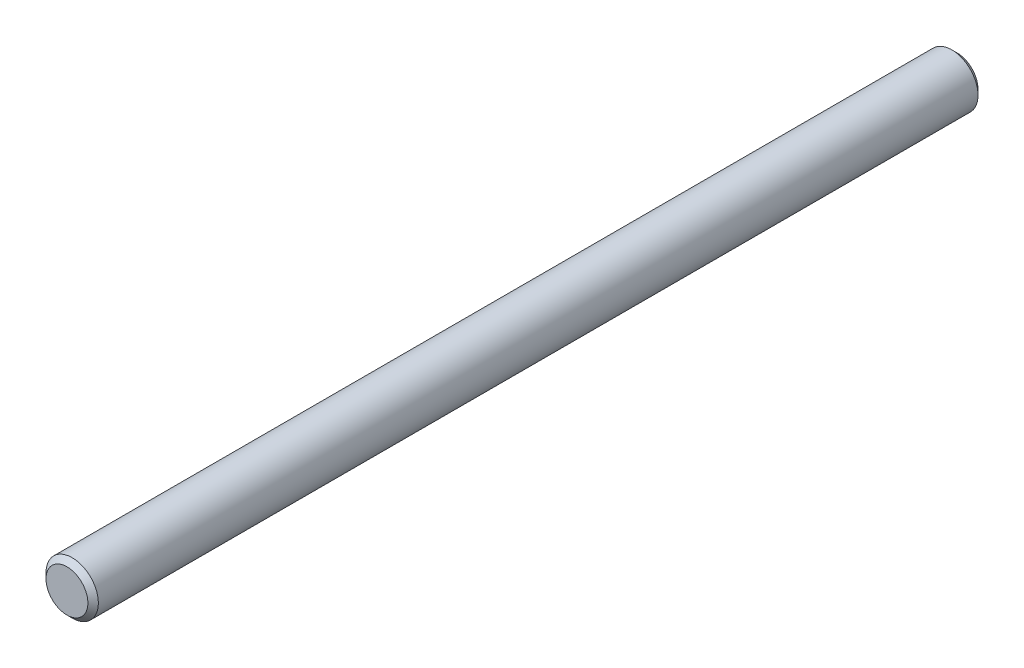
from build123d import *

# Parameters (mm, degrees)
ESQUISSE1_R          = 5
BASE_EXTRUSION_DEPTH = 170
CHANFREIN1_SIZE      = 1


with BuildPart() as part:
    # Esquisse1 → Base-Extrusion (new body)
    with BuildSketch(Plane.XY):
        Circle(ESQUISSE1_R)
    extrude(amount=BASE_EXTRUSION_DEPTH)

    # Chanfrein1
    chanfrein1_edges = [part.edges().sort_by_distance(p)[0] for p in [
        (-5, 0, 0),
        (-5, 0, 170),
    ]]
    chamfer(chanfrein1_edges, length=CHANFREIN1_SIZE)


solid = part.part
